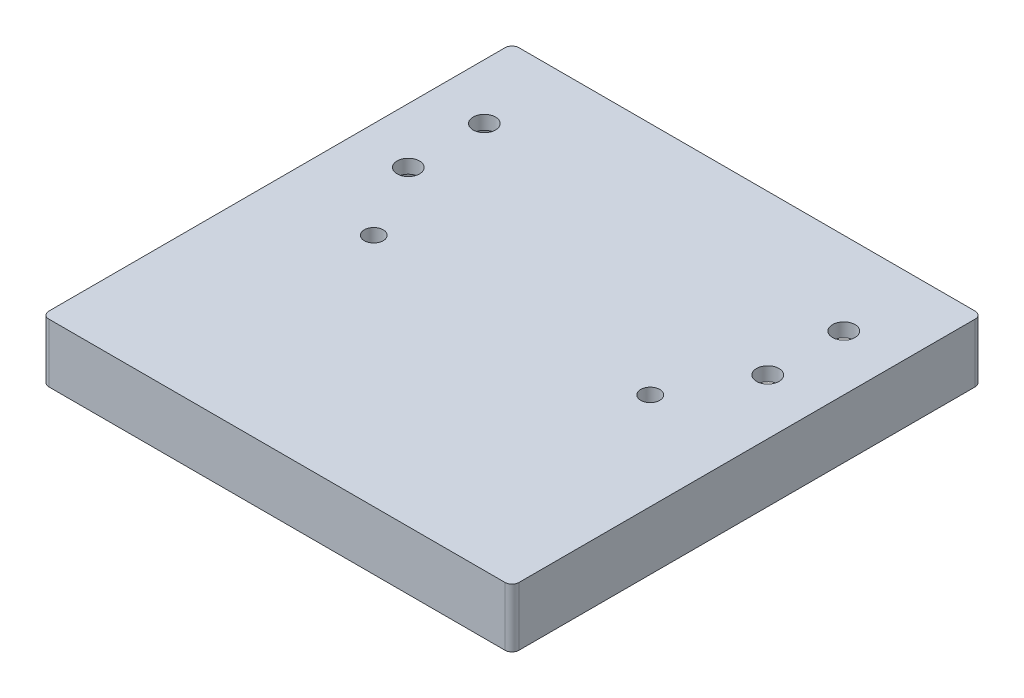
ISO-10303-21;
HEADER;
FILE_DESCRIPTION(('STEP AP214'),'2;1');
FILE_NAME('part.step','',(''),(''),'','','');
FILE_SCHEMA(('AUTOMOTIVE_DESIGN { 1 0 10303 214 1 1 1 1 }'));
ENDSEC;
DATA;
#1=APPLICATION_CONTEXT('core data for automotive mechanical design processes');
#2=APPLICATION_PROTOCOL_DEFINITION('international standard','automotive_design',2000,#1);
#3=PRODUCT_CONTEXT('',#1,'mechanical');
#4=PRODUCT('Part','Part','',(#3));
#5=PRODUCT_RELATED_PRODUCT_CATEGORY('part','',(#4));
#6=PRODUCT_DEFINITION_FORMATION('','',#4);
#7=PRODUCT_DEFINITION_CONTEXT('part definition',#1,'design');
#8=PRODUCT_DEFINITION('design','',#6,#7);
#9=PRODUCT_DEFINITION_SHAPE('','',#8);
#10=(LENGTH_UNIT() NAMED_UNIT(*) SI_UNIT(.MILLI.,.METRE.));
#11=(NAMED_UNIT(*) PLANE_ANGLE_UNIT() SI_UNIT($,.RADIAN.));
#12=(NAMED_UNIT(*) SI_UNIT($,.STERADIAN.) SOLID_ANGLE_UNIT());
#13=UNCERTAINTY_MEASURE_WITH_UNIT(LENGTH_MEASURE(1.E-05),#10,'distance_accuracy_value','');
#14=(GEOMETRIC_REPRESENTATION_CONTEXT(3) GLOBAL_UNCERTAINTY_ASSIGNED_CONTEXT((#13)) GLOBAL_UNIT_ASSIGNED_CONTEXT((#10,
#11,#12)) REPRESENTATION_CONTEXT('',''));
#15=CARTESIAN_POINT('',(0.,0.,0.));
#16=DIRECTION('',(0.,0.,1.));
#17=DIRECTION('',(1.,0.,0.));
#18=AXIS2_PLACEMENT_3D('',#15,#16,#17);
#19=CARTESIAN_POINT('',(-101.483389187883,17.,-21.4257145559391));
#20=DIRECTION('',(0.,-1.,0.));
#21=DIRECTION('',(0.,0.,-1.));
#22=AXIS2_PLACEMENT_3D('',#19,#20,#21);
#23=CYLINDRICAL_SURFACE('',#22,3.25000000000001);
#24=CARTESIAN_POINT('',(-101.483389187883,17.,-21.4257145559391));
#25=DIRECTION('',(0.,1.,0.));
#26=DIRECTION('',(0.,0.,1.));
#27=AXIS2_PLACEMENT_3D('',#24,#25,#26);
#28=CIRCLE('',#27,3.25000000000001);
#29=CARTESIAN_POINT('',(-101.483389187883,17.,-18.1757145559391));
#30=VERTEX_POINT('',#29);
#31=EDGE_CURVE('E157',#30,#30,#28,.T.);
#32=ORIENTED_EDGE('',*,*,#31,.T.);
#33=EDGE_LOOP('',(#32));
#34=FACE_BOUND('',#33,.T.);
#35=CARTESIAN_POINT('',(-101.483389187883,13.,-21.4257145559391));
#36=DIRECTION('',(0.,-1.,0.));
#37=DIRECTION('',(0.,0.,-1.));
#38=AXIS2_PLACEMENT_3D('',#35,#36,#37);
#39=CIRCLE('',#38,3.25000000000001);
#40=CARTESIAN_POINT('',(-101.483389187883,13.,-24.6757145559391));
#41=VERTEX_POINT('',#40);
#42=EDGE_CURVE('E220',#41,#41,#39,.T.);
#43=ORIENTED_EDGE('',*,*,#42,.T.);
#44=EDGE_LOOP('',(#43));
#45=FACE_BOUND('',#44,.T.);
#46=ADVANCED_FACE('F42',(#34,#45),#23,.F.);
#47=CARTESIAN_POINT('',(-101.483389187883,17.,0.574285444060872));
#48=DIRECTION('',(0.,-1.,0.));
#49=DIRECTION('',(0.,0.,-1.));
#50=AXIS2_PLACEMENT_3D('',#47,#48,#49);
#51=CYLINDRICAL_SURFACE('',#50,3.25000000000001);
#52=CARTESIAN_POINT('',(-101.483389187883,17.,0.574285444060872));
#53=DIRECTION('',(0.,1.,0.));
#54=DIRECTION('',(0.,0.,1.));
#55=AXIS2_PLACEMENT_3D('',#52,#53,#54);
#56=CIRCLE('',#55,3.25000000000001);
#57=CARTESIAN_POINT('',(-101.483389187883,17.,3.82428544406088));
#58=VERTEX_POINT('',#57);
#59=EDGE_CURVE('E205',#58,#58,#56,.T.);
#60=ORIENTED_EDGE('',*,*,#59,.T.);
#61=EDGE_LOOP('',(#60));
#62=FACE_BOUND('',#61,.T.);
#63=CARTESIAN_POINT('',(-101.483389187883,13.,0.574285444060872));
#64=DIRECTION('',(0.,-1.,0.));
#65=DIRECTION('',(0.,0.,-1.));
#66=AXIS2_PLACEMENT_3D('',#63,#64,#65);
#67=CIRCLE('',#66,3.25000000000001);
#68=CARTESIAN_POINT('',(-101.483389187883,13.,-2.67571455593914));
#69=VERTEX_POINT('',#68);
#70=EDGE_CURVE('E223',#69,#69,#67,.T.);
#71=ORIENTED_EDGE('',*,*,#70,.T.);
#72=EDGE_LOOP('',(#71));
#73=FACE_BOUND('',#72,.T.);
#74=ADVANCED_FACE('F363',(#62,#73),#51,.F.);
#75=CARTESIAN_POINT('',(2.51661081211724,17.,-21.4257145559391));
#76=DIRECTION('',(0.,-1.,0.));
#77=DIRECTION('',(0.,0.,-1.));
#78=AXIS2_PLACEMENT_3D('',#75,#76,#77);
#79=CYLINDRICAL_SURFACE('',#78,3.25);
#80=CARTESIAN_POINT('',(2.51661081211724,17.,-21.4257145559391));
#81=DIRECTION('',(0.,1.,0.));
#82=DIRECTION('',(0.,0.,1.));
#83=AXIS2_PLACEMENT_3D('',#80,#81,#82);
#84=CIRCLE('',#83,3.25);
#85=CARTESIAN_POINT('',(2.51661081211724,17.,-18.1757145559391));
#86=VERTEX_POINT('',#85);
#87=EDGE_CURVE('E208',#86,#86,#84,.T.);
#88=ORIENTED_EDGE('',*,*,#87,.T.);
#89=EDGE_LOOP('',(#88));
#90=FACE_BOUND('',#89,.T.);
#91=CARTESIAN_POINT('',(2.51661081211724,13.,-21.4257145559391));
#92=DIRECTION('',(0.,-1.,0.));
#93=DIRECTION('',(0.,0.,-1.));
#94=AXIS2_PLACEMENT_3D('',#91,#92,#93);
#95=CIRCLE('',#94,3.25);
#96=CARTESIAN_POINT('',(2.51661081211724,13.,-24.6757145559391));
#97=VERTEX_POINT('',#96);
#98=EDGE_CURVE('E226',#97,#97,#95,.T.);
#99=ORIENTED_EDGE('',*,*,#98,.T.);
#100=EDGE_LOOP('',(#99));
#101=FACE_BOUND('',#100,.T.);
#102=ADVANCED_FACE('F369',(#90,#101),#79,.F.);
#103=CARTESIAN_POINT('',(2.51661081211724,17.,0.574285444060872));
#104=DIRECTION('',(0.,-1.,0.));
#105=DIRECTION('',(0.,0.,-1.));
#106=AXIS2_PLACEMENT_3D('',#103,#104,#105);
#107=CYLINDRICAL_SURFACE('',#106,3.25);
#108=CARTESIAN_POINT('',(2.51661081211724,17.,0.574285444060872));
#109=DIRECTION('',(0.,1.,0.));
#110=DIRECTION('',(0.,0.,1.));
#111=AXIS2_PLACEMENT_3D('',#108,#109,#110);
#112=CIRCLE('',#111,3.25);
#113=CARTESIAN_POINT('',(2.51661081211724,17.,3.82428544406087));
#114=VERTEX_POINT('',#113);
#115=EDGE_CURVE('E211',#114,#114,#112,.T.);
#116=ORIENTED_EDGE('',*,*,#115,.T.);
#117=EDGE_LOOP('',(#116));
#118=FACE_BOUND('',#117,.T.);
#119=CARTESIAN_POINT('',(2.51661081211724,13.,0.574285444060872));
#120=DIRECTION('',(0.,-1.,0.));
#121=DIRECTION('',(0.,0.,-1.));
#122=AXIS2_PLACEMENT_3D('',#119,#120,#121);
#123=CIRCLE('',#122,3.25);
#124=CARTESIAN_POINT('',(2.51661081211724,13.,-2.67571455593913));
#125=VERTEX_POINT('',#124);
#126=EDGE_CURVE('E229',#125,#125,#123,.T.);
#127=ORIENTED_EDGE('',*,*,#126,.T.);
#128=EDGE_LOOP('',(#127));
#129=FACE_BOUND('',#128,.T.);
#130=ADVANCED_FACE('F426',(#118,#129),#107,.F.);
#131=CARTESIAN_POINT('',(-89.4833891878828,17.,22.5742854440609));
#132=DIRECTION('',(0.,-1.,0.));
#133=DIRECTION('',(0.,0.,-1.));
#134=AXIS2_PLACEMENT_3D('',#131,#132,#133);
#135=CYLINDRICAL_SURFACE('',#134,2.75000000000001);
#136=CARTESIAN_POINT('',(-89.4833891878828,17.,22.5742854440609));
#137=DIRECTION('',(0.,1.,0.));
#138=DIRECTION('',(0.,0.,1.));
#139=AXIS2_PLACEMENT_3D('',#136,#137,#138);
#140=CIRCLE('',#139,2.75000000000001);
#141=CARTESIAN_POINT('',(-89.4833891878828,17.,25.3242854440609));
#142=VERTEX_POINT('',#141);
#143=EDGE_CURVE('E214',#142,#142,#140,.T.);
#144=ORIENTED_EDGE('',*,*,#143,.T.);
#145=EDGE_LOOP('',(#144));
#146=FACE_BOUND('',#145,.T.);
#147=CARTESIAN_POINT('',(-89.4833891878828,13.,22.5742854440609));
#148=DIRECTION('',(0.,-1.,0.));
#149=DIRECTION('',(0.,0.,-1.));
#150=AXIS2_PLACEMENT_3D('',#147,#148,#149);
#151=CIRCLE('',#150,2.75000000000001);
#152=CARTESIAN_POINT('',(-89.4833891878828,13.,19.8242854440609));
#153=VERTEX_POINT('',#152);
#154=EDGE_CURVE('E232',#153,#153,#151,.T.);
#155=ORIENTED_EDGE('',*,*,#154,.T.);
#156=EDGE_LOOP('',(#155));
#157=FACE_BOUND('',#156,.T.);
#158=ADVANCED_FACE('F418',(#146,#157),#135,.F.);
#159=CARTESIAN_POINT('',(-9.48338918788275,17.,22.5742854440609));
#160=DIRECTION('',(0.,-1.,0.));
#161=DIRECTION('',(0.,0.,-1.));
#162=AXIS2_PLACEMENT_3D('',#159,#160,#161);
#163=CYLINDRICAL_SURFACE('',#162,2.75);
#164=CARTESIAN_POINT('',(-9.48338918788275,17.,22.5742854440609));
#165=DIRECTION('',(0.,1.,0.));
#166=DIRECTION('',(0.,0.,1.));
#167=AXIS2_PLACEMENT_3D('',#164,#165,#166);
#168=CIRCLE('',#167,2.75);
#169=CARTESIAN_POINT('',(-9.48338918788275,17.,25.3242854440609));
#170=VERTEX_POINT('',#169);
#171=EDGE_CURVE('E217',#170,#170,#168,.T.);
#172=ORIENTED_EDGE('',*,*,#171,.T.);
#173=EDGE_LOOP('',(#172));
#174=FACE_BOUND('',#173,.T.);
#175=CARTESIAN_POINT('',(-9.48338918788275,13.,22.5742854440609));
#176=DIRECTION('',(0.,-1.,0.));
#177=DIRECTION('',(0.,0.,-1.));
#178=AXIS2_PLACEMENT_3D('',#175,#176,#177);
#179=CIRCLE('',#178,2.75);
#180=CARTESIAN_POINT('',(-9.48338918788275,13.,19.8242854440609));
#181=VERTEX_POINT('',#180);
#182=EDGE_CURVE('E46',#181,#181,#179,.T.);
#183=ORIENTED_EDGE('',*,*,#182,.T.);
#184=EDGE_LOOP('',(#183));
#185=FACE_BOUND('',#184,.T.);
#186=ADVANCED_FACE('F377',(#174,#185),#163,.F.);
#187=CARTESIAN_POINT('',(-115.483389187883,17.,88.5742854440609));
#188=DIRECTION('',(0.,1.,0.));
#189=DIRECTION('',(0.,0.,1.));
#190=AXIS2_PLACEMENT_3D('',#187,#188,#189);
#191=PLANE('',#190);
#192=ORIENTED_EDGE('',*,*,#143,.F.);
#193=EDGE_LOOP('',(#192));
#194=FACE_BOUND('',#193,.T.);
#195=ORIENTED_EDGE('',*,*,#87,.F.);
#196=EDGE_LOOP('',(#195));
#197=FACE_BOUND('',#196,.T.);
#198=ORIENTED_EDGE('',*,*,#31,.F.);
#199=EDGE_LOOP('',(#198));
#200=FACE_BOUND('',#199,.T.);
#201=CARTESIAN_POINT('',(-115.483389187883,17.,88.5742854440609));
#202=DIRECTION('',(0.,1.,0.));
#203=DIRECTION('',(0.,0.,1.));
#204=AXIS2_PLACEMENT_3D('',#201,#202,#203);
#205=CIRCLE('',#204,1.99999999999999);
#206=CARTESIAN_POINT('',(-117.483389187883,17.,88.5742854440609));
#207=VERTEX_POINT('',#206);
#208=CARTESIAN_POINT('',(-115.483389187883,17.,90.5742854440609));
#209=VERTEX_POINT('',#208);
#210=EDGE_CURVE('E169',#207,#209,#205,.T.);
#211=ORIENTED_EDGE('',*,*,#210,.T.);
#212=DIRECTION('',(1.,0.,0.));
#213=VECTOR('',#212,1.);
#214=CARTESIAN_POINT('',(-115.483389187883,17.,90.5742854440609));
#215=LINE('',#214,#213);
#216=CARTESIAN_POINT('',(16.5166108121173,17.,90.5742854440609));
#217=VERTEX_POINT('',#216);
#218=EDGE_CURVE('E108',#209,#217,#215,.T.);
#219=ORIENTED_EDGE('',*,*,#218,.T.);
#220=CARTESIAN_POINT('',(16.5166108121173,17.,88.5742854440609));
#221=DIRECTION('',(0.,1.,0.));
#222=DIRECTION('',(0.,0.,1.));
#223=AXIS2_PLACEMENT_3D('',#220,#221,#222);
#224=CIRCLE('',#223,1.99999999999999);
#225=CARTESIAN_POINT('',(18.5166108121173,17.,88.5742854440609));
#226=VERTEX_POINT('',#225);
#227=EDGE_CURVE('E185',#217,#226,#224,.T.);
#228=ORIENTED_EDGE('',*,*,#227,.T.);
#229=DIRECTION('',(0.,0.,-1.));
#230=VECTOR('',#229,1.);
#231=CARTESIAN_POINT('',(18.5166108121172,17.,-43.4257145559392));
#232=LINE('',#231,#230);
#233=CARTESIAN_POINT('',(18.5166108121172,17.,-43.4257145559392));
#234=VERTEX_POINT('',#233);
#235=EDGE_CURVE('E197',#226,#234,#232,.T.);
#236=ORIENTED_EDGE('',*,*,#235,.T.);
#237=CARTESIAN_POINT('',(16.5166108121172,17.,-43.4257145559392));
#238=DIRECTION('',(0.,1.,0.));
#239=DIRECTION('',(0.,0.,-1.));
#240=AXIS2_PLACEMENT_3D('',#237,#238,#239);
#241=CIRCLE('',#240,2.);
#242=CARTESIAN_POINT('',(16.5166108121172,17.,-45.4257145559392));
#243=VERTEX_POINT('',#242);
#244=EDGE_CURVE('E132',#234,#243,#241,.T.);
#245=ORIENTED_EDGE('',*,*,#244,.T.);
#246=DIRECTION('',(-1.,0.,0.));
#247=VECTOR('',#246,1.);
#248=CARTESIAN_POINT('',(-115.483389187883,17.,-45.4257145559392));
#249=LINE('',#248,#247);
#250=CARTESIAN_POINT('',(-115.483389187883,17.,-45.4257145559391));
#251=VERTEX_POINT('',#250);
#252=EDGE_CURVE('E124',#243,#251,#249,.T.);
#253=ORIENTED_EDGE('',*,*,#252,.T.);
#254=CARTESIAN_POINT('',(-115.483389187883,17.,-43.4257145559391));
#255=DIRECTION('',(0.,1.,0.));
#256=DIRECTION('',(0.,0.,1.));
#257=AXIS2_PLACEMENT_3D('',#254,#255,#256);
#258=CIRCLE('',#257,2.00000000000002);
#259=CARTESIAN_POINT('',(-117.483389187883,17.,-43.4257145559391));
#260=VERTEX_POINT('',#259);
#261=EDGE_CURVE('E129',#251,#260,#258,.T.);
#262=ORIENTED_EDGE('',*,*,#261,.T.);
#263=DIRECTION('',(0.,0.,1.));
#264=VECTOR('',#263,1.);
#265=CARTESIAN_POINT('',(-117.483389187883,17.,-43.4257145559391));
#266=LINE('',#265,#264);
#267=EDGE_CURVE('E67',#260,#207,#266,.T.);
#268=ORIENTED_EDGE('',*,*,#267,.T.);
#269=EDGE_LOOP('',(#211,#219,#228,#236,#245,#253,#262,#268));
#270=FACE_BOUND('',#269,.T.);
#271=ORIENTED_EDGE('',*,*,#59,.F.);
#272=EDGE_LOOP('',(#271));
#273=FACE_BOUND('',#272,.T.);
#274=ORIENTED_EDGE('',*,*,#115,.F.);
#275=EDGE_LOOP('',(#274));
#276=FACE_BOUND('',#275,.T.);
#277=ORIENTED_EDGE('',*,*,#171,.F.);
#278=EDGE_LOOP('',(#277));
#279=FACE_BOUND('',#278,.T.);
#280=ADVANCED_FACE('F126',(#194,#197,#200,#270,#273,#276,#279),#191,.T.);
#281=CARTESIAN_POINT('',(-115.483389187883,0.,88.5742854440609));
#282=DIRECTION('',(0.,1.,0.));
#283=DIRECTION('',(0.,0.,1.));
#284=AXIS2_PLACEMENT_3D('',#281,#282,#283);
#285=PLANE('',#284);
#286=DIRECTION('',(1.,0.,0.));
#287=VECTOR('',#286,1.);
#288=CARTESIAN_POINT('',(-113.483389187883,0.,-41.4257145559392));
#289=LINE('',#288,#287);
#290=CARTESIAN_POINT('',(-113.483389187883,0.,-41.4257145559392));
#291=VERTEX_POINT('',#290);
#292=CARTESIAN_POINT('',(14.5166108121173,0.,-41.4257145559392));
#293=VERTEX_POINT('',#292);
#294=EDGE_CURVE('E253',#291,#293,#289,.T.);
#295=ORIENTED_EDGE('',*,*,#294,.F.);
#296=DIRECTION('',(0.,0.,-1.));
#297=VECTOR('',#296,1.);
#298=CARTESIAN_POINT('',(-113.483389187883,0.,86.5742854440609));
#299=LINE('',#298,#297);
#300=CARTESIAN_POINT('',(-113.483389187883,0.,86.5742854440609));
#301=VERTEX_POINT('',#300);
#302=EDGE_CURVE('E58',#301,#291,#299,.T.);
#303=ORIENTED_EDGE('',*,*,#302,.F.);
#304=DIRECTION('',(-1.,0.,0.));
#305=VECTOR('',#304,1.);
#306=CARTESIAN_POINT('',(-113.483389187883,0.,86.5742854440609));
#307=LINE('',#306,#305);
#308=CARTESIAN_POINT('',(14.5166108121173,0.,86.5742854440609));
#309=VERTEX_POINT('',#308);
#310=EDGE_CURVE('E246',#309,#301,#307,.T.);
#311=ORIENTED_EDGE('',*,*,#310,.F.);
#312=DIRECTION('',(0.,0.,1.));
#313=VECTOR('',#312,1.);
#314=CARTESIAN_POINT('',(14.5166108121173,0.,86.5742854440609));
#315=LINE('',#314,#313);
#316=EDGE_CURVE('E250',#293,#309,#315,.T.);
#317=ORIENTED_EDGE('',*,*,#316,.F.);
#318=EDGE_LOOP('',(#295,#303,#311,#317));
#319=FACE_BOUND('',#318,.T.);
#320=CARTESIAN_POINT('',(-115.483389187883,0.,88.5742854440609));
#321=DIRECTION('',(0.,1.,0.));
#322=DIRECTION('',(0.,0.,1.));
#323=AXIS2_PLACEMENT_3D('',#320,#321,#322);
#324=CIRCLE('',#323,1.99999999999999);
#325=CARTESIAN_POINT('',(-117.483389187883,0.,88.5742854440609));
#326=VERTEX_POINT('',#325);
#327=CARTESIAN_POINT('',(-115.483389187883,0.,90.5742854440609));
#328=VERTEX_POINT('',#327);
#329=EDGE_CURVE('E153',#326,#328,#324,.T.);
#330=ORIENTED_EDGE('',*,*,#329,.F.);
#331=DIRECTION('',(0.,0.,1.));
#332=VECTOR('',#331,1.);
#333=CARTESIAN_POINT('',(-117.483389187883,0.,-43.4257145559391));
#334=LINE('',#333,#332);
#335=CARTESIAN_POINT('',(-117.483389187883,0.,-43.4257145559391));
#336=VERTEX_POINT('',#335);
#337=EDGE_CURVE('E100',#336,#326,#334,.T.);
#338=ORIENTED_EDGE('',*,*,#337,.F.);
#339=CARTESIAN_POINT('',(-115.483389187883,0.,-43.4257145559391));
#340=DIRECTION('',(0.,1.,0.));
#341=DIRECTION('',(0.,0.,1.));
#342=AXIS2_PLACEMENT_3D('',#339,#340,#341);
#343=CIRCLE('',#342,2.00000000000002);
#344=CARTESIAN_POINT('',(-115.483389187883,0.,-45.4257145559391));
#345=VERTEX_POINT('',#344);
#346=EDGE_CURVE('E166',#345,#336,#343,.T.);
#347=ORIENTED_EDGE('',*,*,#346,.F.);
#348=DIRECTION('',(-1.,0.,0.));
#349=VECTOR('',#348,1.);
#350=CARTESIAN_POINT('',(-115.483389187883,0.,-45.4257145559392));
#351=LINE('',#350,#349);
#352=CARTESIAN_POINT('',(16.5166108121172,0.,-45.4257145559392));
#353=VERTEX_POINT('',#352);
#354=EDGE_CURVE('E141',#353,#345,#351,.T.);
#355=ORIENTED_EDGE('',*,*,#354,.F.);
#356=CARTESIAN_POINT('',(16.5166108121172,0.,-43.4257145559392));
#357=DIRECTION('',(0.,1.,0.));
#358=DIRECTION('',(0.,0.,-1.));
#359=AXIS2_PLACEMENT_3D('',#356,#357,#358);
#360=CIRCLE('',#359,2.);
#361=CARTESIAN_POINT('',(18.5166108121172,0.,-43.4257145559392));
#362=VERTEX_POINT('',#361);
#363=EDGE_CURVE('E163',#362,#353,#360,.T.);
#364=ORIENTED_EDGE('',*,*,#363,.F.);
#365=DIRECTION('',(0.,0.,-1.));
#366=VECTOR('',#365,1.);
#367=CARTESIAN_POINT('',(18.5166108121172,0.,-43.4257145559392));
#368=LINE('',#367,#366);
#369=CARTESIAN_POINT('',(18.5166108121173,0.,88.5742854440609));
#370=VERTEX_POINT('',#369);
#371=EDGE_CURVE('E161',#370,#362,#368,.T.);
#372=ORIENTED_EDGE('',*,*,#371,.F.);
#373=CARTESIAN_POINT('',(16.5166108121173,0.,88.5742854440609));
#374=DIRECTION('',(0.,1.,0.));
#375=DIRECTION('',(0.,0.,1.));
#376=AXIS2_PLACEMENT_3D('',#373,#374,#375);
#377=CIRCLE('',#376,1.99999999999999);
#378=CARTESIAN_POINT('',(16.5166108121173,0.,90.5742854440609));
#379=VERTEX_POINT('',#378);
#380=EDGE_CURVE('E159',#379,#370,#377,.T.);
#381=ORIENTED_EDGE('',*,*,#380,.F.);
#382=DIRECTION('',(1.,0.,0.));
#383=VECTOR('',#382,1.);
#384=CARTESIAN_POINT('',(-115.483389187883,0.,90.5742854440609));
#385=LINE('',#384,#383);
#386=EDGE_CURVE('E156',#328,#379,#385,.T.);
#387=ORIENTED_EDGE('',*,*,#386,.F.);
#388=EDGE_LOOP('',(#330,#338,#347,#355,#364,#372,#381,#387));
#389=FACE_BOUND('',#388,.T.);
#390=ADVANCED_FACE('F189',(#319,#389),#285,.F.);
#391=CARTESIAN_POINT('',(-115.483389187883,17.,88.5742854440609));
#392=DIRECTION('',(0.,-1.,0.));
#393=DIRECTION('',(0.,0.,-1.));
#394=AXIS2_PLACEMENT_3D('',#391,#392,#393);
#395=CYLINDRICAL_SURFACE('',#394,1.99999999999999);
#396=ORIENTED_EDGE('',*,*,#329,.T.);
#397=DIRECTION('',(0.,-1.,0.));
#398=VECTOR('',#397,1.);
#399=CARTESIAN_POINT('',(-115.483389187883,17.,90.5742854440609));
#400=LINE('',#399,#398);
#401=EDGE_CURVE('E11',#209,#328,#400,.T.);
#402=ORIENTED_EDGE('',*,*,#401,.F.);
#403=ORIENTED_EDGE('',*,*,#210,.F.);
#404=DIRECTION('',(0.,-1.,0.));
#405=VECTOR('',#404,1.);
#406=CARTESIAN_POINT('',(-117.483389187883,17.,88.5742854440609));
#407=LINE('',#406,#405);
#408=EDGE_CURVE('E149',#207,#326,#407,.T.);
#409=ORIENTED_EDGE('',*,*,#408,.T.);
#410=EDGE_LOOP('',(#396,#402,#403,#409));
#411=FACE_BOUND('',#410,.T.);
#412=ADVANCED_FACE('F44',(#411),#395,.T.);
#413=CARTESIAN_POINT('',(-115.483389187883,17.,90.5742854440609));
#414=DIRECTION('',(0.,0.,-1.));
#415=DIRECTION('',(-1.,0.,0.));
#416=AXIS2_PLACEMENT_3D('',#413,#414,#415);
#417=PLANE('',#416);
#418=ORIENTED_EDGE('',*,*,#386,.T.);
#419=DIRECTION('',(0.,-1.,0.));
#420=VECTOR('',#419,1.);
#421=CARTESIAN_POINT('',(16.5166108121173,17.,90.5742854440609));
#422=LINE('',#421,#420);
#423=EDGE_CURVE('E51',#217,#379,#422,.T.);
#424=ORIENTED_EDGE('',*,*,#423,.F.);
#425=ORIENTED_EDGE('',*,*,#218,.F.);
#426=ORIENTED_EDGE('',*,*,#401,.T.);
#427=EDGE_LOOP('',(#418,#424,#425,#426));
#428=FACE_BOUND('',#427,.T.);
#429=ADVANCED_FACE('F393',(#428),#417,.F.);
#430=CARTESIAN_POINT('',(16.5166108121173,17.,88.5742854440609));
#431=DIRECTION('',(0.,-1.,0.));
#432=DIRECTION('',(0.,0.,-1.));
#433=AXIS2_PLACEMENT_3D('',#430,#431,#432);
#434=CYLINDRICAL_SURFACE('',#433,1.99999999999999);
#435=ORIENTED_EDGE('',*,*,#380,.T.);
#436=DIRECTION('',(0.,-1.,0.));
#437=VECTOR('',#436,1.);
#438=CARTESIAN_POINT('',(18.5166108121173,17.,88.5742854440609));
#439=LINE('',#438,#437);
#440=EDGE_CURVE('E176',#226,#370,#439,.T.);
#441=ORIENTED_EDGE('',*,*,#440,.F.);
#442=ORIENTED_EDGE('',*,*,#227,.F.);
#443=ORIENTED_EDGE('',*,*,#423,.T.);
#444=EDGE_LOOP('',(#435,#441,#442,#443));
#445=FACE_BOUND('',#444,.T.);
#446=ADVANCED_FACE('F183',(#445),#434,.T.);
#447=CARTESIAN_POINT('',(18.5166108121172,17.,-43.4257145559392));
#448=DIRECTION('',(-1.,0.,0.));
#449=DIRECTION('',(0.,0.,1.));
#450=AXIS2_PLACEMENT_3D('',#447,#448,#449);
#451=PLANE('',#450);
#452=ORIENTED_EDGE('',*,*,#371,.T.);
#453=DIRECTION('',(0.,-1.,0.));
#454=VECTOR('',#453,1.);
#455=CARTESIAN_POINT('',(18.5166108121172,17.,-43.4257145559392));
#456=LINE('',#455,#454);
#457=EDGE_CURVE('E173',#234,#362,#456,.T.);
#458=ORIENTED_EDGE('',*,*,#457,.F.);
#459=ORIENTED_EDGE('',*,*,#235,.F.);
#460=ORIENTED_EDGE('',*,*,#440,.T.);
#461=EDGE_LOOP('',(#452,#458,#459,#460));
#462=FACE_BOUND('',#461,.T.);
#463=ADVANCED_FACE('F193',(#462),#451,.F.);
#464=CARTESIAN_POINT('',(16.5166108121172,17.,-43.4257145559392));
#465=DIRECTION('',(0.,-1.,0.));
#466=DIRECTION('',(0.,0.,-1.));
#467=AXIS2_PLACEMENT_3D('',#464,#465,#466);
#468=CYLINDRICAL_SURFACE('',#467,2.);
#469=ORIENTED_EDGE('',*,*,#363,.T.);
#470=DIRECTION('',(0.,-1.,0.));
#471=VECTOR('',#470,1.);
#472=CARTESIAN_POINT('',(16.5166108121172,17.,-45.4257145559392));
#473=LINE('',#472,#471);
#474=EDGE_CURVE('E144',#243,#353,#473,.T.);
#475=ORIENTED_EDGE('',*,*,#474,.F.);
#476=ORIENTED_EDGE('',*,*,#244,.F.);
#477=ORIENTED_EDGE('',*,*,#457,.T.);
#478=EDGE_LOOP('',(#469,#475,#476,#477));
#479=FACE_BOUND('',#478,.T.);
#480=ADVANCED_FACE('F196',(#479),#468,.T.);
#481=CARTESIAN_POINT('',(-115.483389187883,17.,-45.4257145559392));
#482=DIRECTION('',(0.,0.,1.));
#483=DIRECTION('',(1.,0.,0.));
#484=AXIS2_PLACEMENT_3D('',#481,#482,#483);
#485=PLANE('',#484);
#486=ORIENTED_EDGE('',*,*,#354,.T.);
#487=DIRECTION('',(0.,-1.,0.));
#488=VECTOR('',#487,1.);
#489=CARTESIAN_POINT('',(-115.483389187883,17.,-45.4257145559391));
#490=LINE('',#489,#488);
#491=EDGE_CURVE('E138',#251,#345,#490,.T.);
#492=ORIENTED_EDGE('',*,*,#491,.F.);
#493=ORIENTED_EDGE('',*,*,#252,.F.);
#494=ORIENTED_EDGE('',*,*,#474,.T.);
#495=EDGE_LOOP('',(#486,#492,#493,#494));
#496=FACE_BOUND('',#495,.T.);
#497=ADVANCED_FACE('F139',(#496),#485,.F.);
#498=CARTESIAN_POINT('',(-115.483389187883,17.,-43.4257145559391));
#499=DIRECTION('',(0.,-1.,0.));
#500=DIRECTION('',(0.,0.,-1.));
#501=AXIS2_PLACEMENT_3D('',#498,#499,#500);
#502=CYLINDRICAL_SURFACE('',#501,2.00000000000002);
#503=ORIENTED_EDGE('',*,*,#346,.T.);
#504=DIRECTION('',(0.,-1.,0.));
#505=VECTOR('',#504,1.);
#506=CARTESIAN_POINT('',(-117.483389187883,17.,-43.4257145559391));
#507=LINE('',#506,#505);
#508=EDGE_CURVE('E145',#260,#336,#507,.T.);
#509=ORIENTED_EDGE('',*,*,#508,.F.);
#510=ORIENTED_EDGE('',*,*,#261,.F.);
#511=ORIENTED_EDGE('',*,*,#491,.T.);
#512=EDGE_LOOP('',(#503,#509,#510,#511));
#513=FACE_BOUND('',#512,.T.);
#514=ADVANCED_FACE('F147',(#513),#502,.T.);
#515=CARTESIAN_POINT('',(-117.483389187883,17.,-43.4257145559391));
#516=DIRECTION('',(1.,0.,0.));
#517=DIRECTION('',(0.,0.,-1.));
#518=AXIS2_PLACEMENT_3D('',#515,#516,#517);
#519=PLANE('',#518);
#520=ORIENTED_EDGE('',*,*,#337,.T.);
#521=ORIENTED_EDGE('',*,*,#408,.F.);
#522=ORIENTED_EDGE('',*,*,#267,.F.);
#523=ORIENTED_EDGE('',*,*,#508,.T.);
#524=EDGE_LOOP('',(#520,#521,#522,#523));
#525=FACE_BOUND('',#524,.T.);
#526=ADVANCED_FACE('F381',(#525),#519,.F.);
#527=CARTESIAN_POINT('',(-113.483389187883,13.,86.5742854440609));
#528=DIRECTION('',(-1.,0.,0.));
#529=DIRECTION('',(0.,0.,1.));
#530=AXIS2_PLACEMENT_3D('',#527,#528,#529);
#531=PLANE('',#530);
#532=ORIENTED_EDGE('',*,*,#302,.T.);
#533=DIRECTION('',(0.,-1.,0.));
#534=VECTOR('',#533,1.);
#535=CARTESIAN_POINT('',(-113.483389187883,13.,-41.4257145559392));
#536=LINE('',#535,#534);
#537=CARTESIAN_POINT('',(-113.483389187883,13.,-41.4257145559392));
#538=VERTEX_POINT('',#537);
#539=EDGE_CURVE('E235',#538,#291,#536,.T.);
#540=ORIENTED_EDGE('',*,*,#539,.F.);
#541=DIRECTION('',(0.,0.,-1.));
#542=VECTOR('',#541,1.);
#543=CARTESIAN_POINT('',(-113.483389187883,13.,86.5742854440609));
#544=LINE('',#543,#542);
#545=CARTESIAN_POINT('',(-113.483389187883,13.,86.5742854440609));
#546=VERTEX_POINT('',#545);
#547=EDGE_CURVE('E249',#546,#538,#544,.T.);
#548=ORIENTED_EDGE('',*,*,#547,.F.);
#549=DIRECTION('',(0.,-1.,0.));
#550=VECTOR('',#549,1.);
#551=CARTESIAN_POINT('',(-113.483389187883,13.,86.5742854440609));
#552=LINE('',#551,#550);
#553=EDGE_CURVE('E244',#546,#301,#552,.T.);
#554=ORIENTED_EDGE('',*,*,#553,.T.);
#555=EDGE_LOOP('',(#532,#540,#548,#554));
#556=FACE_BOUND('',#555,.T.);
#557=ADVANCED_FACE('F322',(#556),#531,.F.);
#558=CARTESIAN_POINT('',(-113.483389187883,13.,86.5742854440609));
#559=DIRECTION('',(0.,0.,1.));
#560=DIRECTION('',(1.,0.,0.));
#561=AXIS2_PLACEMENT_3D('',#558,#559,#560);
#562=PLANE('',#561);
#563=ORIENTED_EDGE('',*,*,#310,.T.);
#564=ORIENTED_EDGE('',*,*,#553,.F.);
#565=DIRECTION('',(-1.,0.,0.));
#566=VECTOR('',#565,1.);
#567=CARTESIAN_POINT('',(-113.483389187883,13.,86.5742854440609));
#568=LINE('',#567,#566);
#569=CARTESIAN_POINT('',(14.5166108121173,13.,86.5742854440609));
#570=VERTEX_POINT('',#569);
#571=EDGE_CURVE('E238',#570,#546,#568,.T.);
#572=ORIENTED_EDGE('',*,*,#571,.F.);
#573=DIRECTION('',(0.,-1.,0.));
#574=VECTOR('',#573,1.);
#575=CARTESIAN_POINT('',(14.5166108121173,13.,86.5742854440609));
#576=LINE('',#575,#574);
#577=EDGE_CURVE('E241',#570,#309,#576,.T.);
#578=ORIENTED_EDGE('',*,*,#577,.T.);
#579=EDGE_LOOP('',(#563,#564,#572,#578));
#580=FACE_BOUND('',#579,.T.);
#581=ADVANCED_FACE('F334',(#580),#562,.F.);
#582=CARTESIAN_POINT('',(14.5166108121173,13.,86.5742854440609));
#583=DIRECTION('',(1.,0.,0.));
#584=DIRECTION('',(0.,0.,-1.));
#585=AXIS2_PLACEMENT_3D('',#582,#583,#584);
#586=PLANE('',#585);
#587=ORIENTED_EDGE('',*,*,#316,.T.);
#588=ORIENTED_EDGE('',*,*,#577,.F.);
#589=DIRECTION('',(0.,0.,1.));
#590=VECTOR('',#589,1.);
#591=CARTESIAN_POINT('',(14.5166108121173,13.,86.5742854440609));
#592=LINE('',#591,#590);
#593=CARTESIAN_POINT('',(14.5166108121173,13.,-41.4257145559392));
#594=VERTEX_POINT('',#593);
#595=EDGE_CURVE('E260',#594,#570,#592,.T.);
#596=ORIENTED_EDGE('',*,*,#595,.F.);
#597=DIRECTION('',(0.,-1.,0.));
#598=VECTOR('',#597,1.);
#599=CARTESIAN_POINT('',(14.5166108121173,13.,-41.4257145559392));
#600=LINE('',#599,#598);
#601=EDGE_CURVE('E237',#594,#293,#600,.T.);
#602=ORIENTED_EDGE('',*,*,#601,.T.);
#603=EDGE_LOOP('',(#587,#588,#596,#602));
#604=FACE_BOUND('',#603,.T.);
#605=ADVANCED_FACE('F339',(#604),#586,.F.);
#606=CARTESIAN_POINT('',(-113.483389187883,13.,-41.4257145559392));
#607=DIRECTION('',(0.,0.,-1.));
#608=DIRECTION('',(-1.,0.,0.));
#609=AXIS2_PLACEMENT_3D('',#606,#607,#608);
#610=PLANE('',#609);
#611=ORIENTED_EDGE('',*,*,#294,.T.);
#612=ORIENTED_EDGE('',*,*,#601,.F.);
#613=DIRECTION('',(1.,0.,0.));
#614=VECTOR('',#613,1.);
#615=CARTESIAN_POINT('',(-113.483389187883,13.,-41.4257145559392));
#616=LINE('',#615,#614);
#617=EDGE_CURVE('E263',#538,#594,#616,.T.);
#618=ORIENTED_EDGE('',*,*,#617,.F.);
#619=ORIENTED_EDGE('',*,*,#539,.T.);
#620=EDGE_LOOP('',(#611,#612,#618,#619));
#621=FACE_BOUND('',#620,.T.);
#622=ADVANCED_FACE('F301',(#621),#610,.F.);
#623=CARTESIAN_POINT('',(0.,13.,0.));
#624=DIRECTION('',(0.,-1.,0.));
#625=DIRECTION('',(0.,0.,-1.));
#626=AXIS2_PLACEMENT_3D('',#623,#624,#625);
#627=PLANE('',#626);
#628=CARTESIAN_POINT('',(-49.4833891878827,13.,22.5742854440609));
#629=DIRECTION('',(0.,-1.,0.));
#630=DIRECTION('',(0.,0.,-1.));
#631=AXIS2_PLACEMENT_3D('',#628,#629,#630);
#632=CIRCLE('',#631,5.);
#633=CARTESIAN_POINT('',(-49.4833891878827,13.,27.5742854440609));
#634=VERTEX_POINT('',#633);
#635=EDGE_CURVE('E268',#634,#634,#632,.T.);
#636=ORIENTED_EDGE('',*,*,#635,.F.);
#637=EDGE_LOOP('',(#636));
#638=FACE_BOUND('',#637,.T.);
#639=ORIENTED_EDGE('',*,*,#42,.F.);
#640=EDGE_LOOP('',(#639));
#641=FACE_BOUND('',#640,.T.);
#642=ORIENTED_EDGE('',*,*,#70,.F.);
#643=EDGE_LOOP('',(#642));
#644=FACE_BOUND('',#643,.T.);
#645=ORIENTED_EDGE('',*,*,#98,.F.);
#646=EDGE_LOOP('',(#645));
#647=FACE_BOUND('',#646,.T.);
#648=ORIENTED_EDGE('',*,*,#126,.F.);
#649=EDGE_LOOP('',(#648));
#650=FACE_BOUND('',#649,.T.);
#651=ORIENTED_EDGE('',*,*,#154,.F.);
#652=EDGE_LOOP('',(#651));
#653=FACE_BOUND('',#652,.T.);
#654=ORIENTED_EDGE('',*,*,#182,.F.);
#655=EDGE_LOOP('',(#654));
#656=FACE_BOUND('',#655,.T.);
#657=ORIENTED_EDGE('',*,*,#547,.T.);
#658=ORIENTED_EDGE('',*,*,#617,.T.);
#659=ORIENTED_EDGE('',*,*,#595,.T.);
#660=ORIENTED_EDGE('',*,*,#571,.T.);
#661=EDGE_LOOP('',(#657,#658,#659,#660));
#662=FACE_BOUND('',#661,.T.);
#663=ADVANCED_FACE('F295',(#638,#641,#644,#647,#650,#653,#656,#662),#627,.T.);
#664=CARTESIAN_POINT('',(-49.4833891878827,0.,22.5742854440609));
#665=DIRECTION('',(0.,1.,0.));
#666=DIRECTION('',(0.,0.,1.));
#667=AXIS2_PLACEMENT_3D('',#664,#665,#666);
#668=CYLINDRICAL_SURFACE('',#667,5.);
#669=CARTESIAN_POINT('',(-49.4833891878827,0.,22.5742854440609));
#670=DIRECTION('',(0.,-1.,0.));
#671=DIRECTION('',(0.,0.,-1.));
#672=AXIS2_PLACEMENT_3D('',#669,#670,#671);
#673=CIRCLE('',#672,5.);
#674=CARTESIAN_POINT('',(-49.4833891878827,0.,27.5742854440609));
#675=VERTEX_POINT('',#674);
#676=EDGE_CURVE('E257',#675,#675,#673,.T.);
#677=CARTESIAN_POINT('',(-49.4833891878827,0.,27.5742854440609));
#678=CARTESIAN_POINT('',(-49.4833891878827,0.135416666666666,27.5742854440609));
#679=CARTESIAN_POINT('',(-49.4833891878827,0.270833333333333,27.5742854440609));
#680=CARTESIAN_POINT('',(-49.4833891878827,0.541666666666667,27.5742854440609));
#681=CARTESIAN_POINT('',(-49.4833891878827,0.677083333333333,27.5742854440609));
#682=CARTESIAN_POINT('',(-49.4833891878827,0.947916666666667,27.5742854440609));
#683=CARTESIAN_POINT('',(-49.4833891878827,1.08333333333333,27.5742854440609));
#684=CARTESIAN_POINT('',(-49.4833891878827,1.35416666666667,27.5742854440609));
#685=CARTESIAN_POINT('',(-49.4833891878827,1.48958333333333,27.5742854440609));
#686=CARTESIAN_POINT('',(-49.4833891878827,1.76041666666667,27.5742854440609));
#687=CARTESIAN_POINT('',(-49.4833891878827,1.89583333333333,27.5742854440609));
#688=CARTESIAN_POINT('',(-49.4833891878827,2.16666666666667,27.5742854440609));
#689=CARTESIAN_POINT('',(-49.4833891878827,2.30208333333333,27.5742854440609));
#690=CARTESIAN_POINT('',(-49.4833891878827,2.57291666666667,27.5742854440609));
#691=CARTESIAN_POINT('',(-49.4833891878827,2.70833333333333,27.5742854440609));
#692=CARTESIAN_POINT('',(-49.4833891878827,2.97916666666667,27.5742854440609));
#693=CARTESIAN_POINT('',(-49.4833891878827,3.11458333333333,27.5742854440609));
#694=CARTESIAN_POINT('',(-49.4833891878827,3.38541666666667,27.5742854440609));
#695=CARTESIAN_POINT('',(-49.4833891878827,3.52083333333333,27.5742854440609));
#696=CARTESIAN_POINT('',(-49.4833891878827,3.79166666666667,27.5742854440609));
#697=CARTESIAN_POINT('',(-49.4833891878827,3.92708333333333,27.5742854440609));
#698=CARTESIAN_POINT('',(-49.4833891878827,4.19791666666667,27.5742854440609));
#699=CARTESIAN_POINT('',(-49.4833891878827,4.33333333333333,27.5742854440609));
#700=CARTESIAN_POINT('',(-49.4833891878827,4.60416666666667,27.5742854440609));
#701=CARTESIAN_POINT('',(-49.4833891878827,4.73958333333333,27.5742854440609));
#702=CARTESIAN_POINT('',(-49.4833891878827,5.01041666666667,27.5742854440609));
#703=CARTESIAN_POINT('',(-49.4833891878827,5.14583333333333,27.5742854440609));
#704=CARTESIAN_POINT('',(-49.4833891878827,5.41666666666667,27.5742854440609));
#705=CARTESIAN_POINT('',(-49.4833891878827,5.55208333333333,27.5742854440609));
#706=CARTESIAN_POINT('',(-49.4833891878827,5.82291666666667,27.5742854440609));
#707=CARTESIAN_POINT('',(-49.4833891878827,5.95833333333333,27.5742854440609));
#708=CARTESIAN_POINT('',(-49.4833891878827,6.22916666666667,27.5742854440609));
#709=CARTESIAN_POINT('',(-49.4833891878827,6.36458333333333,27.5742854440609));
#710=CARTESIAN_POINT('',(-49.4833891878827,6.63541666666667,27.5742854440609));
#711=CARTESIAN_POINT('',(-49.4833891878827,6.77083333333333,27.5742854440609));
#712=CARTESIAN_POINT('',(-49.4833891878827,7.04166666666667,27.5742854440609));
#713=CARTESIAN_POINT('',(-49.4833891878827,7.17708333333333,27.5742854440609));
#714=CARTESIAN_POINT('',(-49.4833891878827,7.44791666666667,27.5742854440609));
#715=CARTESIAN_POINT('',(-49.4833891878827,7.58333333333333,27.5742854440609));
#716=CARTESIAN_POINT('',(-49.4833891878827,7.85416666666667,27.5742854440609));
#717=CARTESIAN_POINT('',(-49.4833891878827,7.98958333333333,27.5742854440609));
#718=CARTESIAN_POINT('',(-49.4833891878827,8.26041666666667,27.5742854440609));
#719=CARTESIAN_POINT('',(-49.4833891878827,8.39583333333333,27.5742854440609));
#720=CARTESIAN_POINT('',(-49.4833891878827,8.66666666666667,27.5742854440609));
#721=CARTESIAN_POINT('',(-49.4833891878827,8.80208333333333,27.5742854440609));
#722=CARTESIAN_POINT('',(-49.4833891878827,9.07291666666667,27.5742854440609));
#723=CARTESIAN_POINT('',(-49.4833891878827,9.20833333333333,27.5742854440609));
#724=CARTESIAN_POINT('',(-49.4833891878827,9.47916666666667,27.5742854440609));
#725=CARTESIAN_POINT('',(-49.4833891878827,9.61458333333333,27.5742854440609));
#726=CARTESIAN_POINT('',(-49.4833891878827,9.88541666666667,27.5742854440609));
#727=CARTESIAN_POINT('',(-49.4833891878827,10.0208333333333,27.5742854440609));
#728=CARTESIAN_POINT('',(-49.4833891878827,10.2916666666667,27.5742854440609));
#729=CARTESIAN_POINT('',(-49.4833891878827,10.4270833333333,27.5742854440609));
#730=CARTESIAN_POINT('',(-49.4833891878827,10.6979166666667,27.5742854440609));
#731=CARTESIAN_POINT('',(-49.4833891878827,10.8333333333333,27.5742854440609));
#732=CARTESIAN_POINT('',(-49.4833891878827,11.1041666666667,27.5742854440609));
#733=CARTESIAN_POINT('',(-49.4833891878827,11.2395833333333,27.5742854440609));
#734=CARTESIAN_POINT('',(-49.4833891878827,11.5104166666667,27.5742854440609));
#735=CARTESIAN_POINT('',(-49.4833891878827,11.6458333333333,27.5742854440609));
#736=CARTESIAN_POINT('',(-49.4833891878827,11.9166666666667,27.5742854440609));
#737=CARTESIAN_POINT('',(-49.4833891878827,12.0520833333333,27.5742854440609));
#738=CARTESIAN_POINT('',(-49.4833891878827,12.3229166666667,27.5742854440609));
#739=CARTESIAN_POINT('',(-49.4833891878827,12.4583333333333,27.5742854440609));
#740=CARTESIAN_POINT('',(-49.4833891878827,12.7291666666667,27.5742854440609));
#741=CARTESIAN_POINT('',(-49.4833891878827,12.8645833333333,27.5742854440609));
#742=CARTESIAN_POINT('',(-49.4833891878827,13.,27.5742854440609));
#743=B_SPLINE_CURVE_WITH_KNOTS('',3,(#677,#678,#679,#680,#681,#682,#683,#684,#685,#686,#687,
#688,#689,#690,#691,#692,#693,#694,#695,#696,#697,#698,#699,#700,#701,#702,#703,#704,#705,#706,
#707,#708,#709,#710,#711,#712,#713,#714,#715,#716,#717,#718,#719,#720,#721,#722,#723,#724,#725,
#726,#727,#728,#729,#730,#731,#732,#733,#734,#735,#736,#737,#738,#739,#740,#741,#742),
.UNSPECIFIED.,.F.,.F.,(4,2,2,2,2,2,2,2,2,2,2,2,2,2,2,2,2,2,2,2,2,2,2,2,2,2,2,2,2,2,2,2,4),(0.,
0.40625,0.8125,1.21875,1.625,2.03125,2.4375,2.84375,3.25,3.65625,4.0625,4.46875,4.875,5.28125,
5.6875,6.09375,6.5,6.90625,7.3125,7.71875,8.125,8.53125,8.9375,9.34375,9.75,10.15625,10.5625,
10.96875,11.375,11.78125,12.1875,12.59375,13.),.UNSPECIFIED.);
#744=EDGE_CURVE('BSEAM289',#675,#634,#743,.T.);
#745=ORIENTED_EDGE('',*,*,#676,.F.);
#746=ORIENTED_EDGE('',*,*,#635,.T.);
#747=ORIENTED_EDGE('',*,*,#744,.T.);
#748=ORIENTED_EDGE('',*,*,#744,.F.);
#749=EDGE_LOOP('',(#745,#747,#746,#748));
#750=FACE_BOUND('',#749,.T.);
#751=ADVANCED_FACE('F289',(#750),#668,.T.);
#752=CARTESIAN_POINT('',(-49.4833891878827,0.,22.5742854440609));
#753=DIRECTION('',(0.,-1.,0.));
#754=DIRECTION('',(0.,0.,-1.));
#755=AXIS2_PLACEMENT_3D('',#752,#753,#754);
#756=PLANE('',#755);
#757=CARTESIAN_POINT('',(-49.4833891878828,0.,22.6681425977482));
#758=DIRECTION('',(0.,-1.,0.));
#759=DIRECTION('',(0.,0.,-1.));
#760=AXIS2_PLACEMENT_3D('',#757,#758,#759);
#761=CIRCLE('',#760,2.525);
#762=CARTESIAN_POINT('',(-49.4833891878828,0.,20.1431425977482));
#763=VERTEX_POINT('',#762);
#764=EDGE_CURVE('E279',#763,#763,#761,.T.);
#765=ORIENTED_EDGE('',*,*,#764,.F.);
#766=EDGE_LOOP('',(#765));
#767=FACE_BOUND('',#766,.T.);
#768=ORIENTED_EDGE('',*,*,#676,.T.);
#769=EDGE_LOOP('',(#768));
#770=FACE_BOUND('',#769,.T.);
#771=ADVANCED_FACE('F285',(#767,#770),#756,.T.);
#772=CARTESIAN_POINT('',(-49.4833891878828,12.,22.6681425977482));
#773=DIRECTION('',(0.,-1.,0.));
#774=DIRECTION('',(0.,0.,-1.));
#775=AXIS2_PLACEMENT_3D('',#772,#773,#774);
#776=CONICAL_SURFACE('',#775,2.1,1.02974425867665);
#777=CARTESIAN_POINT('',(-49.4833891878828,13.2618072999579,22.6681425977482));
#778=VERTEX_POINT('',#777);
#779=VERTEX_LOOP('',#778);
#780=FACE_BOUND('',#779,.T.);
#781=CARTESIAN_POINT('',(-49.4833891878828,12.,22.6681425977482));
#782=DIRECTION('',(0.,-1.,0.));
#783=DIRECTION('',(0.,0.,-1.));
#784=AXIS2_PLACEMENT_3D('',#781,#782,#783);
#785=CIRCLE('',#784,2.1);
#786=CARTESIAN_POINT('',(-49.4833891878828,12.,20.5681425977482));
#787=VERTEX_POINT('',#786);
#788=EDGE_CURVE('E271',#787,#787,#785,.T.);
#789=ORIENTED_EDGE('',*,*,#788,.T.);
#790=EDGE_LOOP('',(#789));
#791=FACE_BOUND('',#790,.T.);
#792=ADVANCED_FACE('F288',(#780,#791),#776,.F.);
#793=CARTESIAN_POINT('',(-49.4833891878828,0.,22.6681425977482));
#794=DIRECTION('',(0.,-1.,0.));
#795=DIRECTION('',(0.,0.,-1.));
#796=AXIS2_PLACEMENT_3D('',#793,#794,#795);
#797=CYLINDRICAL_SURFACE('',#796,2.1);
#798=ORIENTED_EDGE('',*,*,#788,.F.);
#799=EDGE_LOOP('',(#798));
#800=FACE_BOUND('',#799,.T.);
#801=CARTESIAN_POINT('',(-49.4833891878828,0.425,22.6681425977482));
#802=DIRECTION('',(0.,-1.,0.));
#803=DIRECTION('',(0.,0.,-1.));
#804=AXIS2_PLACEMENT_3D('',#801,#802,#803);
#805=CIRCLE('',#804,2.1);
#806=CARTESIAN_POINT('',(-49.4833891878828,0.425,20.5681425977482));
#807=VERTEX_POINT('',#806);
#808=EDGE_CURVE('E276',#807,#807,#805,.T.);
#809=ORIENTED_EDGE('',*,*,#808,.T.);
#810=EDGE_LOOP('',(#809));
#811=FACE_BOUND('',#810,.T.);
#812=ADVANCED_FACE('F349',(#800,#811),#797,.F.);
#813=CARTESIAN_POINT('',(-49.4833891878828,0.,22.6681425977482));
#814=DIRECTION('',(0.,-1.,0.));
#815=DIRECTION('',(0.,0.,-1.));
#816=AXIS2_PLACEMENT_3D('',#813,#814,#815);
#817=CONICAL_SURFACE('',#816,2.525,0.78539816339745);
#818=ORIENTED_EDGE('',*,*,#808,.F.);
#819=EDGE_LOOP('',(#818));
#820=FACE_BOUND('',#819,.T.);
#821=ORIENTED_EDGE('',*,*,#764,.T.);
#822=EDGE_LOOP('',(#821));
#823=FACE_BOUND('',#822,.T.);
#824=ADVANCED_FACE('F283',(#820,#823),#817,.F.);
#825=CLOSED_SHELL('',(#46,#74,#102,#130,#158,#186,#280,#390,#412,#429,#446,#463,#480,#497,#514,
#526,#557,#581,#605,#622,#663,#751,#771,#792,#812,#824));
#826=MANIFOLD_SOLID_BREP('B2',#825);
#827=ADVANCED_BREP_SHAPE_REPRESENTATION('',(#18,#826),#14);
#828=SHAPE_DEFINITION_REPRESENTATION(#9,#827);
ENDSEC;
END-ISO-10303-21;
